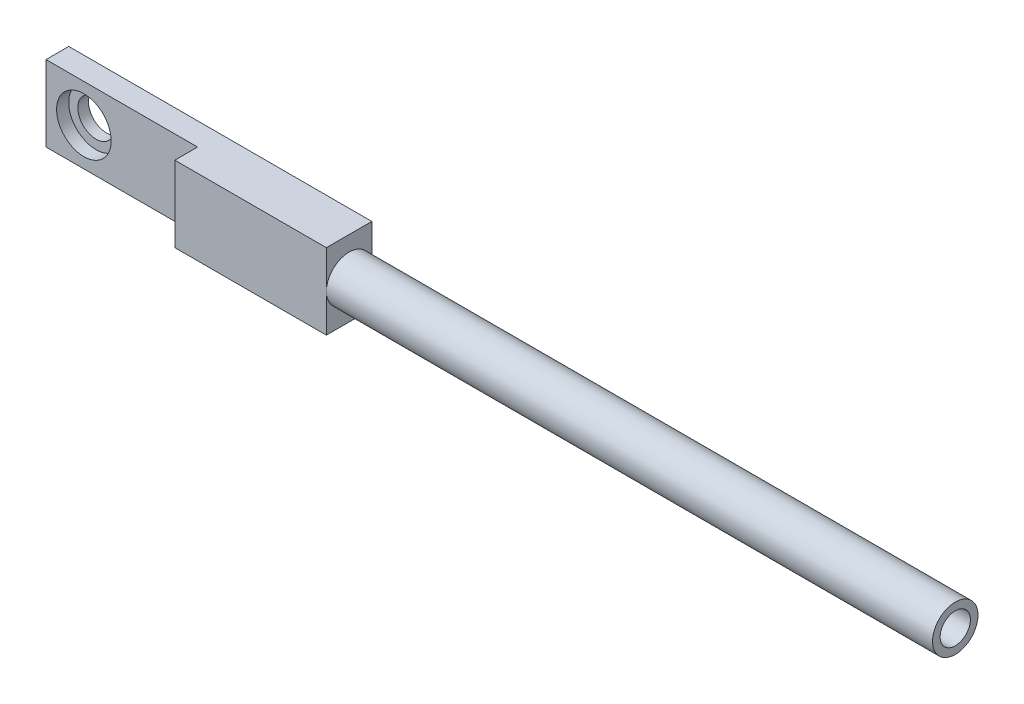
from build123d import *

# Parameters (mm, degrees)
SKETCH1_W           = 100
SKETCH1_H           = 25
BOSS_EXTRUDE1_DEPTH = 15
SKETCH2_R           = 7.5
BOSS_EXTRUDE2_DEPTH = 200
SKETCH3_W           = 50
SKETCH3_H           = 25
CUT_EXTRUDE1_DEPTH  = 7.5
SKETCH4_R           = 5
CUT_EXTRUDE4_DEPTH  = 200
SKETCH9_R           = 6
CUT_EXTRUDE5_DEPTH  = 10
SKETCH10_R          = 9
CUT_EXTRUDE6_DEPTH  = 4


with BuildPart() as part:
    # Sketch1 → Boss-Extrude1 (new body)
    with BuildSketch(Plane.XY):
        with Locations((50, 12.5)):
            Rectangle(SKETCH1_W, SKETCH1_H)
    extrude(amount=BOSS_EXTRUDE1_DEPTH)

    # Sketch2 → Boss-Extrude2 (add)
    with BuildSketch(Plane(origin=(100, 0, 0), x_dir=(0, 0, -1), z_dir=(1, 0, 0))):
        with Locations((-7.5, 12.5)):
            Circle(SKETCH2_R)
    extrude(amount=BOSS_EXTRUDE2_DEPTH)

    # Sketch3 → Cut-Extrude1 (cut)
    with BuildSketch(Plane.XY.offset(15)):
        with Locations((25, 12.5)):
            Rectangle(SKETCH3_W, SKETCH3_H)
    extrude(amount=-CUT_EXTRUDE1_DEPTH, mode=Mode.SUBTRACT)

    # Sketch4 → Cut-Extrude4 (cut)
    with BuildSketch(Plane(origin=(300, 0, 0), x_dir=(0, 0, -1), z_dir=(1, 0, 0))):
        with Locations((-7.5, 12.5)):
            Circle(SKETCH4_R)
    extrude(amount=-CUT_EXTRUDE4_DEPTH, mode=Mode.SUBTRACT)

    # Sketch9 → Cut-Extrude5 (cut)
    with BuildSketch(Plane.XY.offset(7.5)):
        with Locations((12.5, 12.5)):
            Circle(SKETCH9_R)
    extrude(amount=-CUT_EXTRUDE5_DEPTH, mode=Mode.SUBTRACT)

    # Sketch10 → Cut-Extrude6 (cut)
    with BuildSketch(Plane.XY.offset(7.5)):
        with Locations((12.5, 12.5)):
            Circle(SKETCH10_R)
    extrude(amount=-CUT_EXTRUDE6_DEPTH, mode=Mode.SUBTRACT)


solid = part.part
